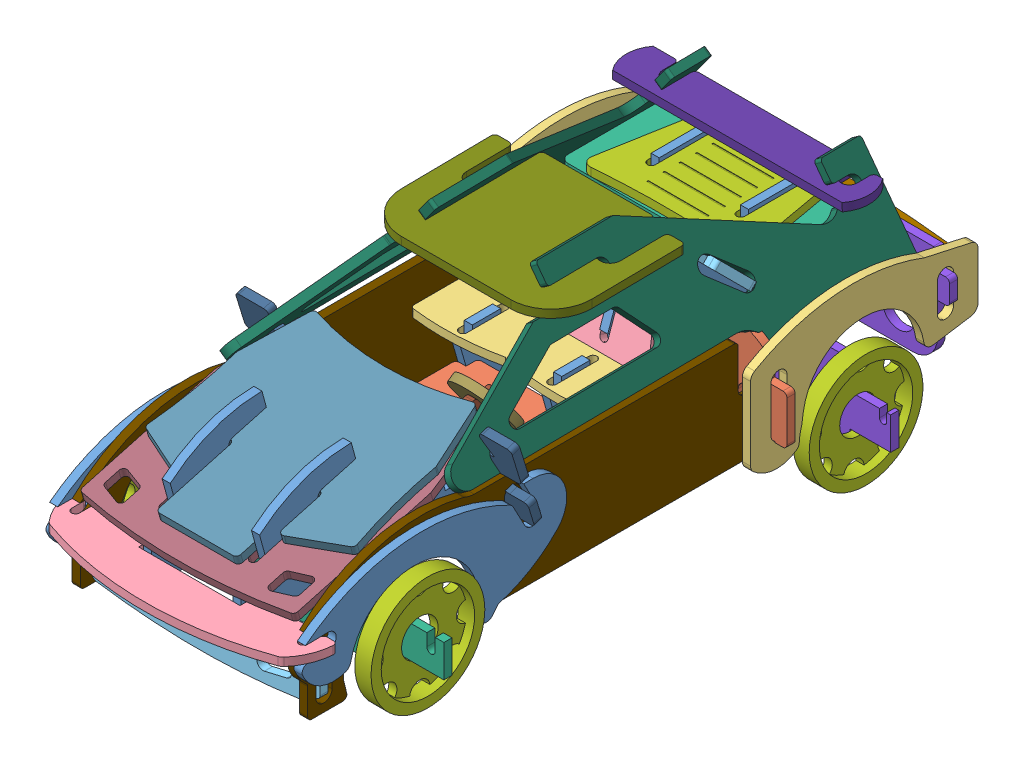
SolidWorks assembly Montagem completa.SLDASM, configuration Valor predeterminado (file format 7000). Lengths in mm.
Overall size (90 67.04 168.2).
35 component instances, 26 part files, 109 mates.
Components (placement in the parent):
- estrutura-1: estrutura.SLDPRT [Valor predeterminado] at (90.9316 123.4316 56.2146) size (2 29.08 156)
- estrutura-2: estrutura.SLDPRT [Valor predeterminado] at (112.9316 123.4316 56.2146) size (2 29.08 156)
- base para os pés-1: base para os pés.SLDPRT [Valor predeterminado] at (102.9316 113.7956 144.786) size (25 2 23)
- asento banco-1: asento banco.SLDPRT [Valor predeterminado] at (102.9316 120.7956 129.0179) x (-1 0 0) z (0 0 -1) size (45 2 15)
- banco encosto-1: banco encosto.SLDPRT [Valor predeterminado] at (102.9316 134.3585 116.7227) x (1 0 0) z (0 0.333333 0.942809) size (44.24 25 2)
- suporte coluna-1: suporte coluna.SLDPRT [Valor predeterminado] at (102.9316 136.8563 102.0534) x (1 0 0) z (0 -0.707107 0.707107) size (54.72 27 2)
- tampa inferior motor traseiro-1: tampa inferior motor traseiro.SLDPRT [Valor predeterminado] at (102.9316 131.4316 82.1288) x (-1 0 0) z (0 0 -1) size (50 2 29)
- tampa superior motor traseiro-1: tampa superior motor traseiro.SLDPRT [Valor predeterminado] at (87.9316 133.4316 68.6288) size (39.22 2 28)
- parachoque traseiro suporte paralama-1: parachoque traseiro suporte paralama.SLDPRT [Valor predeterminado] at (102.9316 114.7989 61.2146) size (75 25 2)
- parachoque traseiro-1: parachoque traseiro.SLDPRT [Valor predeterminado] at (102.9316 123.4316 59.2146) size (67 12 2)
- painel-1: painel.SLDPRT [Valor predeterminado] at (102.9316 131.8774 164.3031) x (1 0 0) z (0 -0.294281 0.955719) size (68 20 2)
- suporte volante-1: suporte volante.SLDPRT [Valor predeterminado] at (116.9316 129.5051 172.0075) x (1 0 0) z (0 -0.294281 0.955719) size (2 11.48 19.74)
- volante-1: volante.SLDPRT [Valor predeterminado] at (117.9316 131.2435 154.1108) x (0.993485 0.093304 0.065429) z (0 -0.574147 0.818752) size (15 15 2)
- capo frontal inferior-1: capo frontal inferior.SLDPRT [Valor predeterminado] at (102.9078 125.1388 188.6553) x (1 0 0) z (0 -0.264309 0.964438) size (53 2 54.7)
- capo fontal superior-1: capo fontal superior.SLDPRT [Valor predeterminado] at (102.9316 128.7857 190.4822) x (1 0 0) z (0 0.264309 -0.964438) size (51.49 2 50.68)
- coluna-1: coluna.SLDPRT [Valor predeterminado] at (135.0922 124.2346 66.3743) x (0.807901 0.589264 0.008019) z (-0.000495 -0.012928 0.999916) size (2 35 110)
- coluna-2: coluna.SLDPRT [Valor predeterminado] at (69.1552 125.4132 66.3904) x (0.807901 -0.589264 -0.008019) z (0.000495 -0.012928 0.999916) size (2 35 110)
- této-1: této.SLDPRT [Valor predeterminado] at (102.3548 145.6092 129.1273) x (1 -0.000006 0.000495) z (-0.000495 -0.012928 0.999916) size (47 2 35)
- aérofolio-1: aérofolio.SLDPRT [Valor predeterminado] at (100.522 138.2554 72.9838) x (1 0.000006 -0.000495) z (0.000495 -0.012928 0.999916) size (60 2 10)
- suporte paralamas-2: suporte paralamas.SLDPRT [Valor predeterminado] at (129.4316 99.9867 101.2555) size (2 30 114)
- paralama dianteiro-2: paralama dianteiro.SLDPRT [Valor predeterminado] at (131.4316 103.8559 208.6038) x (1 0 0) z (0 -0.017452 0.999848) size (2 27.61 65.23)
- gancho paralama traseiro-2: gancho paralama traseiro.SLDPRT [Valor predeterminado] at (125.4316 101.9867 103.2555) size (17 27.52 2)
- paralama traseiro-2: paralama traseiro.SLDPRT [Valor predeterminado] at (137.4316 125.1279 111.2146) size (2 30.08 56)
- parachoque frontal superior-1: parachoque frontal superior.SLDPRT [Valor predeterminado] at (102.4316 112.5581 212.4113) size (64.93 2 15)
- parachoque frontal inferior-1: parachoque frontal inferior.SLDPRT [Valor predeterminado] at (102.4316 104.9867 208.2555) size (60 13 2)
- paralama traseiro-3: paralama traseiro.SLDPRT [Valor predeterminado] at (66.4316 125.1279 111.2146) size (2 30.08 56)
- suporte paralamas-3: suporte paralamas.SLDPRT [Valor predeterminado] at (73.4316 99.9867 101.2555) size (2 30 114)
- gancho paralama traseiro-3: gancho paralama traseiro.SLDPRT [Valor predeterminado] at (80.4316 101.9867 105.2555) x (-1 0 0) z (0 0 -1) size (17 27.52 2)
- paralama dianteiro-3: paralama dianteiro.SLDPRT [Valor predeterminado] at (71.4316 103.8581 209.8059) size (2 27.61 65.23)
- eixo menor-1: eixo menor.SLDPRT [Valor predeterminado] at (102.9316 96.5904 188.2146) size (80 17 2)
- roda-1: roda.SLDPRT [Valor predeterminado] at (132.9316 105.5904 188.153) size (4 28 28)
- roda-2: roda.SLDPRT [Valor predeterminado] at (72.9316 105.5904 188.153) x (-1 0 0) z (0 -0.924225 -0.381849) size (4 28 28)
- eixo maior-1: eixo maior.SLDPRT [Valor predeterminado] at (102.9316 95.1195 83.2146) size (90 20 2)
- roda-3: roda.SLDPRT [Valor predeterminado] at (137.9316 104.1195 85.2761) x (1 0 0) z (0 0.99617 -0.087437) size (4 28 28)
- roda-4: roda.SLDPRT [Valor predeterminado] at (67.9316 104.1195 85.2761) x (-1 0 0) z (0 -0.956523 -0.291657) size (4 28 28)
Mates (geometry in assembly coordinates):
- Distância1: distance = 20 mm anti-aligned: plane of estrutura-1 through (92.9316 123.4316 56.2146) normal (1 0 0); plane of estrutura-2 through (112.9316 123.4316 56.2146) normal (-1 0 0)
- Coincidente2: coincident aligned: plane of estrutura-1 through (92.9316 109.4316 56.2146) normal (0 -1 0); plane of estrutura-2 through (114.9316 109.4316 56.2146) normal (0 -1 0)
- Coincidente3: coincident aligned: plane of estrutura-1 through (92.9316 123.4316 56.2146) normal (0 0 -1); plane of estrutura-2 through (114.9316 123.4316 56.2146) normal (0 0 -1)
- Coincidente4: coincident anti-aligned: plane of estrutura-2 through (114.9316 113.7956 56.2146) normal (0 1 0); plane of base para os pés-1 through (102.9316 113.7956 144.786) normal (0 -1 0)
- Coincidente5: coincident anti-aligned: plane of estrutura-2 through (112.9316 123.4316 56.2146) normal (-1 0 0); plane of base para os pés-1 through (112.9316 115.7956 144.786) normal (1 0 0)
- Coincidente6: coincident: plane of estrutura-2 through (114.9316 102.1006 130.8731) normal (0 -0.274721 0.961524); line of base para os pés-1 through (112.9316 115.7956 134.786) axis (1 0 0)
- Coincidente7: coincident anti-aligned: plane of estrutura-1 through (92.9316 123.4316 56.2146) normal (1 0 0); plane of asento banco-1 through (92.9316 122.7956 129.0179) normal (-1 0 0)
- Coincidente8: coincident anti-aligned: plane of estrutura-2 through (114.9316 120.7956 56.2146) normal (0 1 0); plane of asento banco-1 through (102.9316 120.7956 129.0179) normal (0 -1 0)
- Distância3: distance: line of asento banco-1 through (124.4316 120.7956 121.5179) axis (-1 0 0); line of estrutura-2 through (114.9316 120.7956 121.5179) axis (-1 0 0)
- Coincidente11: coincident anti-aligned: plane of estrutura-2 through (114.9316 143.6616 113.4335) normal (0 0.333333 0.942809); plane of banco encosto-1 through (102.9316 134.3585 116.7227) normal (0 -0.333333 -0.942809)
- Coincidente12: coincident anti-aligned: plane of estrutura-1 through (92.9316 123.4316 56.2146) normal (1 0 0); plane of banco encosto-1 through (92.9316 135.0252 118.6083) normal (-1 0 0)
- Coincidente14: coincident anti-aligned: plane of estrutura-2 through (114.9316 105.8103 73.8359) normal (0 0.707107 -0.707107); plane of suporte coluna-1 through (128.4316 130.0011 98.0266) normal (0 -0.707107 0.707107)
- Coincidente15: coincident anti-aligned: plane of estrutura-2 through (112.9316 123.4316 56.2146) normal (-1 0 0); plane of suporte coluna-1 through (112.9316 126.6032 94.6288) normal (1 0 0)
- Tangente1: tangent: line of estrutura-2 through (112.9316 129.4316 93.2146) axis (0 -0.707107 0.707107); cylinder of suporte coluna-1 through (114.9316 127.3103 95.3359) axis (0 0.707107 -0.707107) radius 2
- Coincidente18: coincident anti-aligned: plane of estrutura-2 through (114.9316 131.4316 56.2146) normal (0 1 0); plane of tampa inferior motor traseiro-1 through (125.9316 131.4316 94.6288) normal (0 -1 0)
- Coincidente20: coincident anti-aligned: plane of estrutura-1 through (92.9316 123.4316 56.2146) normal (1 0 0); plane of tampa inferior motor traseiro-1 through (92.9316 133.4316 87.6288) normal (-1 0 0)
- Coincidente21: coincident: plane of suporte coluna-1 through (128.4316 131.4153 96.6124) normal (0 0.707107 -0.707107); line of tampa inferior motor traseiro-1 through (79.9316 131.4316 96.6288) axis (1 0 0)
- Coincidente22: coincident anti-aligned: plane of tampa inferior motor traseiro-1 through (125.9316 133.4316 94.6288) normal (0 1 0); plane of tampa superior motor traseiro-1 through (120.5429 133.4316 94.6288) normal (0 -1 0)
- Coincidente23: coincident anti-aligned: plane of estrutura-2 through (112.9316 123.4316 56.2146) normal (-1 0 0); plane of tampa superior motor traseiro-1 through (112.9316 135.4316 74.1288) normal (1 0 0)
- Coincidente24: coincident: line of tampa inferior motor traseiro-1 through (79.9316 133.4316 96.6288) axis (1 0 0); point of tampa superior motor traseiro-1
- Coincidente25: coincident anti-aligned: plane of estrutura-2 through (114.9316 123.4316 63.2146) normal (0 0 -1); plane of parachoque traseiro suporte paralama-1 through (131.4316 108.2989 63.2146) normal (0 0 1)
- Coincidente26: coincident anti-aligned: plane of estrutura-1 through (92.9316 123.4316 56.2146) normal (1 0 0); plane of parachoque traseiro suporte paralama-1 through (92.9316 126.2989 63.2146) normal (-1 0 0)
- Distância4: distance = 3.8673 mm aligned: plane of parachoque traseiro suporte paralama-1 through (115.9316 127.2989 63.2146) normal (0 1 0); plane of estrutura-2 through (114.9316 123.4316 56.2146) normal (0 1 0)
- Coincidente28: coincident anti-aligned: plane of parachoque traseiro suporte paralama-1 through (131.4316 108.2989 61.2146) normal (0 0 -1); plane of parachoque traseiro-1 through (91.9316 121.6996 61.2146) normal (0 0 1)
- Coincidente29: coincident anti-aligned: plane of estrutura-2 through (112.9316 123.4316 56.2146) normal (-1 0 0); plane of parachoque traseiro-1 through (112.9316 115.9817 61.2146) normal (1 0 0)
- Coincidente31: coincident anti-aligned: line of estrutura-2 through (112.9316 123.4316 56.2146) axis (0 0 1); line of parachoque traseiro-1 through (112.9316 123.4316 61.2146) axis (0 0 -1)
- Coincidente32: coincident anti-aligned: plane of estrutura-2 through (114.9316 93.1746 154.4786) normal (0 0.294281 -0.955719); plane of painel-1 through (129.8523 135.1117 167.3917) normal (0 -0.294281 0.955719)
- Coincidente33: coincident anti-aligned: plane of estrutura-2 through (112.9316 123.4316 56.2146) normal (-1 0 0); plane of painel-1 through (112.9316 117.9088 162.0946) normal (1 0 0)
- Tangente4: tangent: line of estrutura-2 through (112.9316 124.5299 160.9802) axis (0 -0.294281 0.955719); cylinder of painel-1 through (113.9316 123.6431 163.8603) axis (0 0.294281 -0.955719) radius 1
- Coincidente35: coincident anti-aligned: plane of painel-1 through (129.8523 135.7003 165.4802) normal (0 0.294281 -0.955719); plane of suporte volante-1 through (118.9316 121.8568 161.2176) normal (0 -0.294281 0.955719)
- Coincidente36: coincident anti-aligned: plane of painel-1 through (116.9316 130.3331 165.9203) normal (1 0 0); plane of suporte volante-1 through (116.9316 132.1747 153.5425) normal (-1 0 0)
- Coincidente37: coincident aligned: plane of painel-1 through (119.9316 131.2888 166.2146) normal (0 0.955719 0.294281); plane of suporte volante-1 through (118.9316 129.7994 171.0518) normal (0 0.955719 0.294281)
- Coincidente38: coincident: line of suporte volante-1 through (118.9316 132.9935 154.1166) axis (0 -0.574147 0.818752); cylinder of volante-1 through (117.9316 130.0952 155.7483) axis (0 0.574147 -0.818752) radius 1.75
- Coincidente39: coincident: line of suporte volante-1 through (116.9316 132.9935 154.1166) axis (0 -0.574147 0.818752); cylinder of volante-1 through (117.9316 130.0952 155.7483) axis (0 0.574147 -0.818752) radius 1.75
- Coincidente40: coincident anti-aligned: plane of suporte volante-1 through (118.9316 133.1316 157.8776) normal (0 0.574147 -0.818752); plane of volante-1 through (117.9316 130.0952 155.7483) normal (0 -0.574147 0.818752)
- Coincidente41: coincident anti-aligned: plane of estrutura-2 through (114.9316 158.78 65.9019) normal (0 0.964438 0.264309); plane of capo frontal inferior-1 through (102.9197 149.9261 98.209) normal (0 -0.964438 -0.264309)
- Coincidente42: coincident anti-aligned: plane of estrutura-2 through (112.9316 123.4316 56.2146) normal (-1 0 0); plane of capo frontal inferior-1 through (112.9316 129.0501 181.9505) normal (1 0 0)
- Coincidente48: coincident: line of asento banco-1 through (124.4316 122.7956 121.5179) axis (-1 0 0); plane of banco encosto-1 through (102.9316 123.24 122.7749) normal (0 -0.942809 0.333333)
- Coincidente49: coincident anti-aligned: plane of capo frontal inferior-1 through (102.9197 151.8549 98.7376) normal (0 0.964438 0.264309); plane of capo fontal superior-1 through (91.9316 126.1977 192.3584) normal (0 -0.964438 -0.264309)
- Coincidente50: coincident anti-aligned: plane of estrutura-2 through (112.9316 123.4316 56.2146) normal (-1 0 0); plane of capo fontal superior-1 through (112.9316 121.4522 209.6744) normal (1 0 0)
- Bloquear2: lock: unknown of estrutura-2; unknown of capo fontal superior-1
- Bloquear3: lock: unknown of capo frontal inferior-1; unknown of capo fontal superior-1
- Coincidente62: coincident: point of suporte coluna-1; plane of coluna-1 through (135.0714 123.6917 108.3708) normal (-0.807901 -0.589264 -0.008019)
- Coincidente71: coincident: point of suporte coluna-1; cylinder of coluna-1 through (127.4136 134.2787 101.9176) axis (0.807901 0.589264 0.008019) radius 2
- Coincidente72: coincident: point of suporte coluna-1; cylinder of coluna-1 through (127.4136 134.2787 101.9176) axis (0.807901 0.589264 0.008019) radius 2
- Coincidente77: coincident: point of suporte coluna-1; cylinder of coluna-2 through (76.8339 135.4572 101.9336) axis (0.807901 -0.589264 -0.008019) radius 2
- Coincidente78: coincident: point of suporte coluna-1; cylinder of coluna-2 through (76.8339 135.4572 101.9336) axis (0.807901 -0.589264 -0.008019) radius 2
- Coincidente79: coincident: line of painel-1 through (74.4316 131.2888 166.2146) axis (0.573462 0.782955 0.241084); plane of coluna-2 through (69.176 124.8702 108.3869) normal (-0.807901 0.589264 0.008019)
- Coincidente80: coincident: point of suporte coluna-1; plane of coluna-2 through (70.7918 123.6917 108.3708) normal (0.807901 -0.589264 -0.008019)
- Coincidente83: coincident: line of coluna-2 through (84.5082 145.6154 128.6492) axis (0.000495 -0.012928 0.999916); plane of této-1 through (115.8511 145.5122 136.6334) normal (0 -0.999916 -0.012928)
- Coincidente84: coincident: line of painel-1 through (129.0331 134.5636 167.2229) axis (0.573462 -0.782955 -0.241084); plane of coluna-1 through (136.6872 124.8702 108.3869) normal (0.807901 0.589264 0.008019)
- Coincidente85: coincident: line of coluna-1 through (121.355 145.6154 128.6492) axis (-0.000495 -0.012928 0.999916); plane of této-1 through (115.8511 145.5122 136.6334) normal (0 -0.999916 -0.012928)
- Coincidente87: coincident: plane of coluna-1 through (136.6872 124.8702 108.3869) normal (0.807901 0.589264 0.008019); line of této-1 through (121.362 145.7965 114.638) axis (-0.000495 -0.012928 0.999916)
- Bloquear6: lock: unknown of painel-1; unknown of coluna-1
- Bloquear7: lock: unknown of capo fontal superior-1; unknown of této-1
- Coincidente89: coincident: line of coluna-1 through (127.276 138.261 72.5523) axis (-0.000495 -0.012928 0.999916); plane of aérofolio-1 through (127.52 138.3073 68.9707) normal (0 -0.999916 -0.012928)
- Coincidente93: coincident: point of coluna-2; plane of aérofolio-1 through (127.52 138.3073 68.9707) normal (0 -0.999916 -0.012928)
- Coincidente94: coincident: plane of coluna-2 through (70.7918 123.6917 108.3708) normal (0.807901 -0.589264 -0.008019); line of aérofolio-1 through (82.52 140.3069 69.0189) axis (0.000495 -0.012928 0.999916)
- Bloquear8: lock: unknown of coluna-2; unknown of aérofolio-1
- Coincidente100: coincident: point of painel-1; plane of suporte paralamas-2 through (131.4316 120.3454 163.6041) normal (0 0.469472 -0.882948)
- Coincidente101: coincident: point of painel-1; cylinder of suporte paralamas-2 through (131.4316 121.2844 161.8382) axis (-1 0 0) radius 2
- Paralelo26: parallel aligned: plane of estrutura-2 through (114.9316 123.4316 56.2146) normal (1 0 0); plane of suporte paralamas-2 through (131.4316 100.9867 169.9671) normal (1 0 0)
- Coincidente104: coincident anti-aligned: plane of suporte paralamas-2 through (131.4316 100.9867 169.9671) normal (1 0 0); plane of paralama dianteiro-2 through (131.4316 107.7859 205.6156) normal (-1 0 0)
- Coincidente105: coincident aligned: plane of suporte paralamas-2 through (131.4316 120.3454 163.6041) normal (0 0.469472 -0.882948); plane of paralama dianteiro-2 through (133.4316 120.4291 163.6486) normal (0 0.469472 -0.882948)
- Coincidente106: coincident aligned: cylinder of suporte paralamas-2 through (131.4316 115.9867 159.0214) axis (-1 0 0) radius 2; circle of paralama dianteiro-2
- Coincidente109: coincident aligned: plane of parachoque traseiro suporte paralama-1 through (137.4316 126.2989 63.2146) normal (1 0 0); plane of gancho paralama traseiro-2 through (137.4316 125.5625 105.2555) normal (1 0 0)
- Coincidente110: coincident anti-aligned: plane of parachoque traseiro suporte paralama-1 through (137.4316 116.2989 63.2146) normal (1 0 0); plane of paralama traseiro-2 through (137.4316 108.7995 83.384) normal (-1 0 0)
- Coincidente111: coincident anti-aligned: plane of parachoque traseiro suporte paralama-1 through (131.4316 108.2989 61.2146) normal (0 0 -1); plane of paralama traseiro-2 through (139.4316 122.2989 61.2146) normal (0 0 1)
- Coincidente113: coincident anti-aligned: plane of suporte paralamas-2 through (131.4316 125.9867 103.2555) normal (0 0 1); plane of gancho paralama traseiro-2 through (141.4316 118.9867 103.2555) normal (0 0 -1)
- Distância6: distance = 2 mm aligned: plane of gancho paralama traseiro-2 through (126.4316 101.9867 105.2555) normal (0 -1 0); plane of suporte paralamas-2 through (131.4316 99.9867 101.2555) normal (0 -1 0)
- Coincidente116: coincident: line of parachoque traseiro suporte paralama-1 through (139.4316 122.2989 61.2146) axis (-1 0 0); cylinder of paralama traseiro-2 through (139.4316 122.2989 63.2146) axis (-1 0 0) radius 2
- Paralelo29: parallel anti-aligned: plane of gancho paralama traseiro-2 through (141.4316 118.9867 105.2555) normal (0 0 1); plane of paralama traseiro-2 through (139.4316 120.9366 106.2146) normal (0 0 -1)
- Coincidente119: coincident anti-aligned: plane of suporte paralamas-2 through (131.4316 112.5581 214.7217) normal (0 1 0); plane of parachoque frontal superior-1 through (115.9316 112.5581 209.4113) normal (0 -1 0)
- Coincidente126: coincident anti-aligned: plane of estrutura-2 through (114.9316 123.4316 56.2146) normal (1 0 0); plane of parachoque frontal superior-1 through (114.9316 114.5581 212.4113) normal (-1 0 0)
- Coincidente127: coincident anti-aligned: plane of suporte paralamas-2 through (129.4316 100.9867 169.9671) normal (-1 0 0); plane of parachoque frontal superior-1 through (129.4316 114.5581 209.4113) normal (1 0 0)
- Bloquear9: lock: unknown of estrutura-2; unknown of parachoque frontal superior-1
- Coincidente151: coincident anti-aligned: plane of suporte paralamas-2 through (131.4316 107.9867 210.2555) normal (0 0 -1); plane of parachoque frontal inferior-1 through (131.4316 106.9867 210.2555) normal (0 0 1)
- Coincidente152: coincident anti-aligned: plane of estrutura-2 through (114.9316 123.4316 56.2146) normal (1 0 0); plane of parachoque frontal inferior-1 through (114.9316 105.9867 210.2555) normal (-1 0 0)
- Coincidente153: coincident: cylinder of suporte paralamas-2 through (131.4316 101.9867 208.2555) axis (-1 0 0) radius 2; line of parachoque frontal inferior-1 through (128.4316 101.9867 210.2555) axis (1 0 0)
- Coincidente154: coincident aligned: plane of paralama traseiro-2 through (139.4316 124.4416 55.2146) normal (0 0 -1); plane of paralama traseiro-3 through (68.4316 124.4416 55.2146) normal (0 0 -1)
- Coincidente155: coincident aligned: plane of paralama traseiro-2 through (139.4316 110.7802 56.9017) normal (0 -0.987688 -0.156434); plane of paralama traseiro-3 through (68.4316 110.7802 56.9017) normal (0 -0.987688 -0.156434)
- Coincidente156: coincident anti-aligned: plane of parachoque traseiro suporte paralama-1 through (68.4316 116.2989 63.2146) normal (-1 0 0); plane of paralama traseiro-3 through (68.4316 108.7995 83.384) normal (1 0 0)
- Coincidente157: coincident aligned: plane of suporte paralamas-2 through (131.4316 99.9867 101.2555) normal (0 0 -1); plane of suporte paralamas-3 through (75.4316 99.9867 101.2555) normal (0 0 -1)
- Coincidente158: coincident aligned: plane of suporte paralamas-2 through (131.4316 99.9867 101.2555) normal (0 -1 0); plane of suporte paralamas-3 through (75.4316 99.9867 101.2555) normal (0 -1 0)
- Coincidente160: coincident aligned: plane of gancho paralama traseiro-2 through (136.6509 101.9867 105.2555) normal (0 -1 0); plane of gancho paralama traseiro-3 through (79.4316 101.9867 103.2555) normal (0 -1 0)
- Paralelo30: parallel anti-aligned: plane of gancho paralama traseiro-2 through (125.4316 102.9867 105.2555) normal (-1 0 0); plane of gancho paralama traseiro-3 through (80.4316 102.9867 103.2555) normal (1 0 0)
- Coincidente162: coincident anti-aligned: plane of suporte paralamas-3 through (75.4316 100.9867 169.9671) normal (1 0 0); plane of gancho paralama traseiro-3 through (75.4316 102.9867 103.2555) normal (-1 0 0)
- Coincidente163: coincident anti-aligned: plane of paralama traseiro-3 through (68.4316 108.7995 83.384) normal (1 0 0); plane of gancho paralama traseiro-3 through (68.4316 125.5625 103.2555) normal (-1 0 0)
- Coincidente164: coincident aligned: plane of gancho paralama traseiro-2 through (141.4316 118.9867 103.2555) normal (0 0 -1); plane of gancho paralama traseiro-3 through (64.4316 118.9867 103.2555) normal (0 0 -1)
- Coincidente165: coincident aligned: plane of suporte paralamas-2 through (131.4316 112.5581 214.7217) normal (0 1 0); plane of paralama dianteiro-3 through (73.4316 112.5581 215.2523) normal (0 1 0)
- Concêntrico1: concentric aligned: cylinder of suporte paralamas-2 through (131.4316 114.5581 210.2555) axis (-1 0 0) radius 2; cylinder of paralama dianteiro-3 through (73.4316 114.5581 210.2555) axis (-1 0 0) radius 2
- Paralelo31: parallel aligned: cylinder of paralama dianteiro-2 through (133.4316 115.9867 159.0214) axis (-1 0 0) radius 2; cylinder of paralama dianteiro-3 through (73.4316 115.1216 160.0193) axis (-1 0 0) radius 2
- Coincidente166: coincident anti-aligned: plane of suporte paralamas-3 through (73.4316 100.9867 169.9671) normal (-1 0 0); plane of paralama dianteiro-3 through (73.4316 107.7352 206.7496) normal (1 0 0)
- Coincidente168: coincident anti-aligned: plane of estrutura-2 through (114.9316 123.4316 56.2146) normal (1 0 0); plane of eixo menor-1 through (114.9316 96.5904 190.2146) normal (-1 0 0)
- Coincidente170: coincident anti-aligned: plane of eixo menor-1 through (132.9316 96.5904 190.2146) normal (1 0 0); plane of roda-1 through (132.9316 105.5904 188.153) normal (-1 0 0)
- Coincidente174: coincident: line of eixo menor-1 through (138.7184 109.5904 190.2146) axis (-1 0 0); cylinder of roda-1 through (134.9316 105.5904 188.153) axis (-1 0 0) radius 4.5
- Coincidente175: coincident: line of eixo menor-1 through (132.9316 101.5904 190.2146) axis (1 0 0); cylinder of roda-1 through (134.9316 105.5904 188.153) axis (-1 0 0) radius 4.5
- Coincidente176: coincident anti-aligned: plane of estrutura-2 through (114.9316 123.4316 188.2146) normal (0 0 1); plane of eixo menor-1 through (102.9316 96.5904 188.2146) normal (0 0 -1)
- Bloquear11: lock: unknown of estrutura-2; unknown of eixo menor-1
- Coincidente178: coincident aligned: plane of eixo menor-1 through (72.9316 96.5904 190.2146) normal (-1 0 0); circle of roda-2
- Concêntrico2: concentric anti-aligned: cylinder of roda-1 through (136.9316 105.5904 188.153) axis (-1 0 0) radius 14; cylinder of roda-2 through (68.9316 105.5904 188.153) axis (1 0 0) radius 14
- Coincidente179: coincident anti-aligned: plane of estrutura-2 through (114.9316 123.4316 83.2146) normal (0 0 1); plane of eixo maior-1 through (102.9316 95.1195 83.2146) normal (0 0 -1)
- Coincidente180: coincident anti-aligned: plane of estrutura-2 through (114.9316 123.4316 56.2146) normal (1 0 0); plane of eixo maior-1 through (114.9316 95.1195 85.2146) normal (-1 0 0)
- Bloquear12: lock: unknown of estrutura-2; unknown of eixo maior-1
- Coincidente185: coincident: line of eixo maior-1 through (145.1825 108.1195 83.2146) axis (-1 0 0); cylinder of roda-3 through (139.9316 104.1195 85.2761) axis (-1 0 0) radius 4.5
- Coincidente186: coincident: line of eixo maior-1 through (137.9316 100.1195 83.2146) axis (1 0 0); cylinder of roda-3 through (139.9316 104.1195 85.2761) axis (-1 0 0) radius 4.5
- Coincidente187: coincident anti-aligned: plane of eixo maior-1 through (137.9316 95.1195 85.2146) normal (1 0 0); plane of roda-3 through (137.9316 104.1195 85.2761) normal (-1 0 0)
- Concêntrico3: concentric anti-aligned: cylinder of roda-3 through (141.9316 104.1195 85.2761) axis (-1 0 0) radius 14; cylinder of roda-4 through (63.9316 104.1195 85.2761) axis (1 0 0) radius 14
- Coincidente188: coincident anti-aligned: plane of eixo maior-1 through (67.9316 95.1195 85.2146) normal (-1 0 0); plane of roda-4 through (67.9316 104.1195 85.2761) normal (1 0 0)
